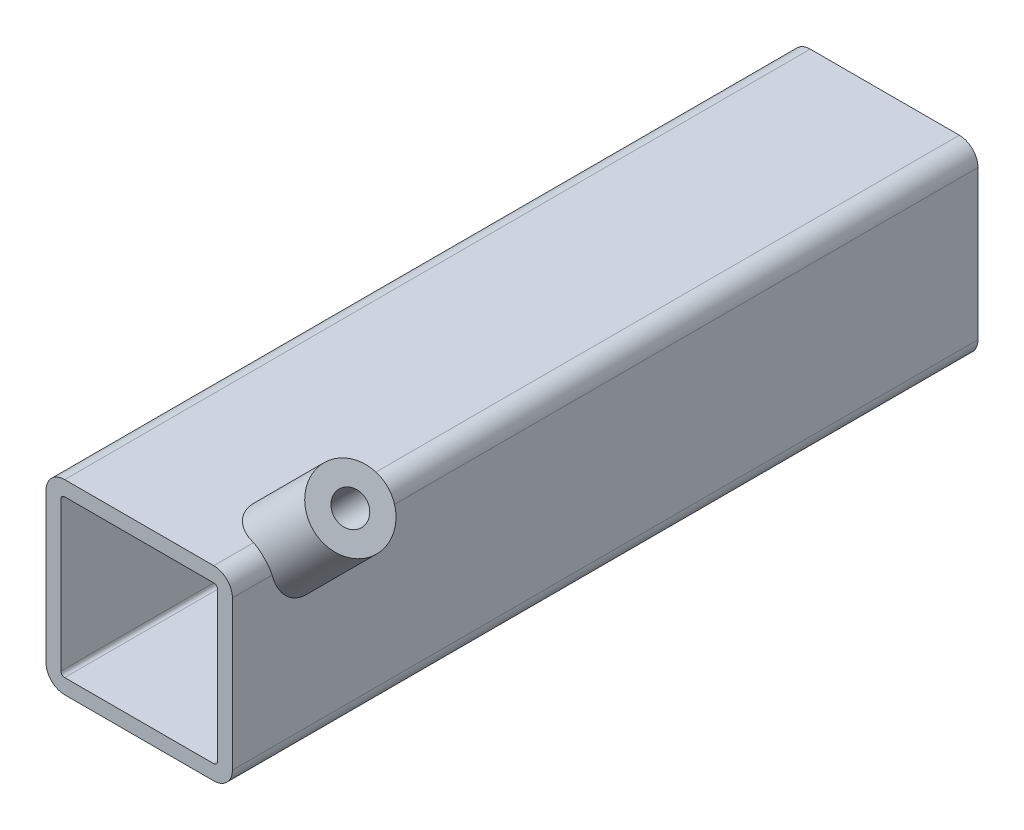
from build123d import *

# Parameters (mm, degrees)
BASE_EXTRUSION_DEPTH    = 200
BOSS_EXTRU_1_DEPTH      = 20
BOSS_EXTRU_1_DEPTH_BACK = 15
ESQUISSE2_R             = 10
ENL_V_MAT_EXTRU_1_DEPTH = 218.305095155
ESQUISSE4_R             = 4.25
ENL_V_MAT_EXTRU_2_DEPTH = 30


with BuildPart() as part:
    # Esquisse1 → Base-Extrusion (new body)
    with BuildSketch(Plane.XY):
        with BuildLine():
            Line((5, 0), (45, 0))
            ThreePointArc((45, 0), (48.535533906, -1.464466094), (50, -5))
            Line((50, -5), (50, -45))
            ThreePointArc((50, -45), (48.535533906, -48.535533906), (45, -50))
            Line((45, -50), (5, -50))
            ThreePointArc((5, -50), (1.464466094, -48.535533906), (0, -45))
            Line((0, -45), (0, -5))
            ThreePointArc((0, -5), (1.464466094, -1.464466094), (5, 0))
        make_face()
    extrude(amount=BASE_EXTRUSION_DEPTH)

    # Esquisse2 → Boss.-Extru.1 (add, two sides: drawn at the far end of the back side and taken through both)
    with BuildSketch(Plane(origin=(22.5, 22.5, 0), x_dir=(0, 0, -1), z_dir=(0.7071067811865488, 0.7071067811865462, 0)).offset(-BOSS_EXTRU_1_DEPTH_BACK)):
        with Locations(Location((-180, -35.355339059, 0), (0, 0, 200.704849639))):
            Circle(ESQUISSE2_R)
    extrude(amount=BOSS_EXTRU_1_DEPTH + BOSS_EXTRU_1_DEPTH_BACK)

    # Esquisse3 → Enl_v. mat.-Extru.1 (cut, through all)
    with BuildSketch(Plane.XY.offset(200)):
        with BuildLine():
            Line((46, -45), (46, -5))
            ThreePointArc((46, -5), (45.707106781, -4.292893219), (45, -4))
            Line((45, -4), (5, -4))
            ThreePointArc((5, -4), (4.292893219, -4.292893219), (4, -5))
            Line((4, -5), (4, -45))
            ThreePointArc((4, -45), (4.292893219, -45.707106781), (5, -46))
            Line((5, -46), (45, -46))
            ThreePointArc((45, -46), (45.707106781, -45.707106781), (46, -45))
        make_face()
    extrude(amount=-ENL_V_MAT_EXTRU_1_DEPTH, mode=Mode.SUBTRACT)

    # Esquisse4 → Enl_v. mat.-Extru.2 (cut)
    with BuildSketch(Plane(origin=(36.642135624, 36.642135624, 0), x_dir=(0, 0, -1), z_dir=(0.7071067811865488, 0.7071067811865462, 0))):
        with Locations(Location((-180, -35.355339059, 0), (0, 0, 90))):
            Circle(ESQUISSE4_R)
    extrude(amount=-ENL_V_MAT_EXTRU_2_DEPTH, mode=Mode.SUBTRACT)


solid = part.part
